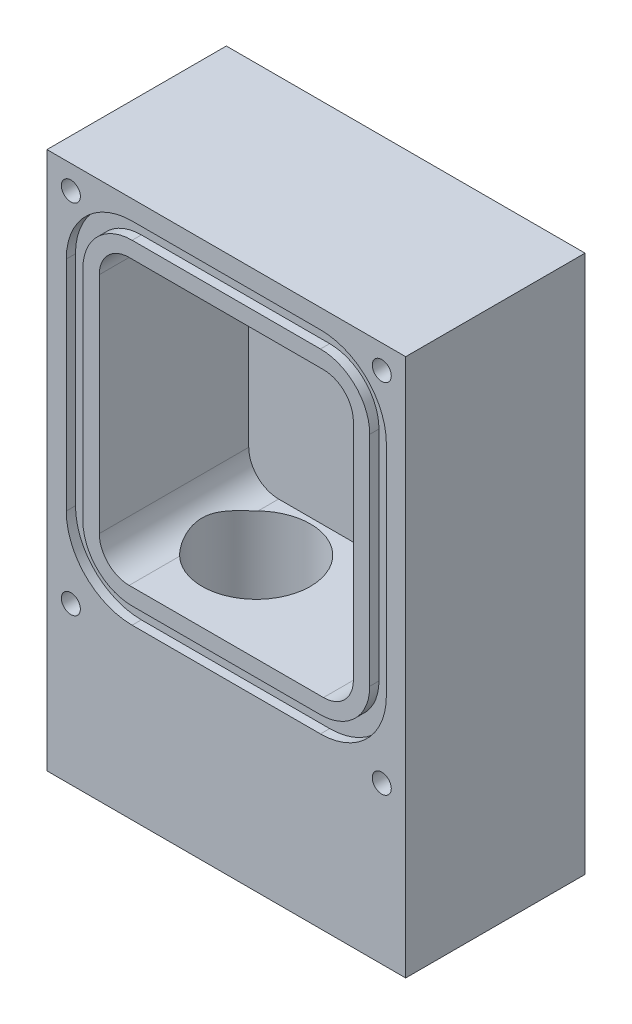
from build123d import *

# Parameters (mm, degrees)
SKETCH1_W                    = 76.2
SKETCH1_H                    = 114.3
BOSS_EXTRUDE1_DEPTH          = 38.1
CUT_EXTRUDE1_DEPTH           = 31.75
F_7_16_20_TAPPED_HOLE1_D     = 9.92124
F_7_16_20_TAPPED_HOLE1_DEPTH = 49.2125
F_7_16_20_TAPPED_HOLE1_TIP   = 5.136872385
CUT_EXTRUDE2_DEPTH           = 1.9558
F_10_32_TAPPED_HOLE1_D       = 4.0386
F_10_32_TAPPED_HOLE1_DEPTH   = 19.05
F_10_32_TAPPED_HOLE1_TIP     = 2.091046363


with BuildPart() as part:
    # Sketch1 → Boss-Extrude1 (new body)
    with BuildSketch(Plane.XY):
        with Locations((38.1, 57.15)):
            Rectangle(SKETCH1_W, SKETCH1_H)
    extrude(amount=BOSS_EXTRUDE1_DEPTH)

    # Sketch2 → Cut-Extrude1 (cut)
    with BuildSketch(Plane.XY.offset(38.1)):
        with BuildLine():
            Line((17.4625, 42.8625), (58.7375, 42.8625))
            ThreePointArc((58.7375, 42.8625), (63.227628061, 44.722371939), (65.0875, 49.2125))
            Line((65.0875, 49.2125), (65.0875, 96.8375))
            ThreePointArc((65.0875, 96.8375), (63.227628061, 101.327628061), (58.7375, 103.1875))
            Line((58.7375, 103.1875), (17.4625, 103.1875))
            ThreePointArc((17.4625, 103.1875), (12.972371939, 101.327628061), (11.1125, 96.8375))
            Line((11.1125, 96.8375), (11.1125, 49.2125))
            ThreePointArc((11.1125, 49.2125), (12.972371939, 44.722371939), (17.4625, 42.8625))
        make_face()
    extrude(amount=-CUT_EXTRUDE1_DEPTH, mode=Mode.SUBTRACT)

    # Sketch5 → 3_4 NPT Tapped Hole1 (revolve, cut)
    with BuildSketch(Plane(origin=(25.4, 0, 19.05), x_dir=(0, 0, -1), z_dir=(1, 0, 0))):
        Polygon((0, 0), (0, 56.126122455), (11.5062, 49.2125), (11.5062, 13.97), (12.933217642, 13.97), (13.3324854, 0.635), (13.9674854, 0), align=None)
    revolve(axis=Axis((25.4, -6.35, 19.05), (0, 1, 0)), mode=Mode.SUBTRACT)

    # 7_16-20 Tapped Hole1
    with Locations(Plane(origin=(0, 0, 0), x_dir=(-1, 0, 0), z_dir=(0, -1, 0))):
        with Locations((-59.69, -19.05)):
            Hole(F_7_16_20_TAPPED_HOLE1_D / 2, depth=F_7_16_20_TAPPED_HOLE1_DEPTH)
            with Locations((0, 0, -(F_7_16_20_TAPPED_HOLE1_DEPTH + F_7_16_20_TAPPED_HOLE1_TIP / 2))):  # 88° drill point
                Cone(0, F_7_16_20_TAPPED_HOLE1_D / 2, F_7_16_20_TAPPED_HOLE1_TIP, mode=Mode.SUBTRACT)

    # Sketch8 → Cut-Extrude2 (cut)
    with BuildSketch(Plane.XY.offset(38.1)):
        with BuildLine():
            Line((4.102097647, 96.2025), (4.102097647, 49.8475))
            ThreePointArc((4.102097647, 49.8475), (8.201255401, 39.951257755), (18.097497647, 35.8521))
            Line((18.097497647, 35.8521), (58.102502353, 35.8521))
            ThreePointArc((58.102502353, 35.8521), (67.998744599, 39.951257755), (72.097902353, 49.8475))
            Line((72.097902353, 49.8475), (72.097902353, 96.2025))
            ThreePointArc((72.097902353, 96.2025), (67.998744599, 106.098742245), (58.102502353, 110.1979))
            Line((58.102502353, 110.1979), (18.097497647, 110.1979))
            ThreePointArc((18.097497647, 110.1979), (8.201255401, 106.098742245), (4.102097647, 96.2025))
        make_face()
        with BuildLine():
            Line((7.632697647, 96.2025), (7.632697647, 49.8475))
            ThreePointArc((7.632697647, 49.8475), (10.697766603, 42.447768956), (18.097497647, 39.3827))
            Line((18.097497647, 39.3827), (58.102502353, 39.3827))
            ThreePointArc((58.102502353, 39.3827), (65.502233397, 42.447768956), (68.567302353, 49.8475))
            Line((68.567302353, 49.8475), (68.567302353, 96.2025))
            ThreePointArc((68.567302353, 96.2025), (65.502233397, 103.602231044), (58.102502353, 106.6673))
            Line((58.102502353, 106.6673), (18.097497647, 106.6673))
            ThreePointArc((18.097497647, 106.6673), (10.697766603, 103.602231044), (7.632697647, 96.2025))
        make_face(mode=Mode.SUBTRACT)
    extrude(amount=-CUT_EXTRUDE2_DEPTH, mode=Mode.SUBTRACT)

    # 10-32 Tapped Hole1
    with Locations(Plane.XY.offset(38.1)):
        with Locations((5.08, 33.3121), (71.12, 33.3121), (71.12, 109.22), (5.08, 109.22)):
            Hole(F_10_32_TAPPED_HOLE1_D / 2, depth=F_10_32_TAPPED_HOLE1_DEPTH)
            with Locations((0, 0, -(F_10_32_TAPPED_HOLE1_DEPTH + F_10_32_TAPPED_HOLE1_TIP / 2))):  # 88° drill point
                Cone(0, F_10_32_TAPPED_HOLE1_D / 2, F_10_32_TAPPED_HOLE1_TIP, mode=Mode.SUBTRACT)


solid = part.part
